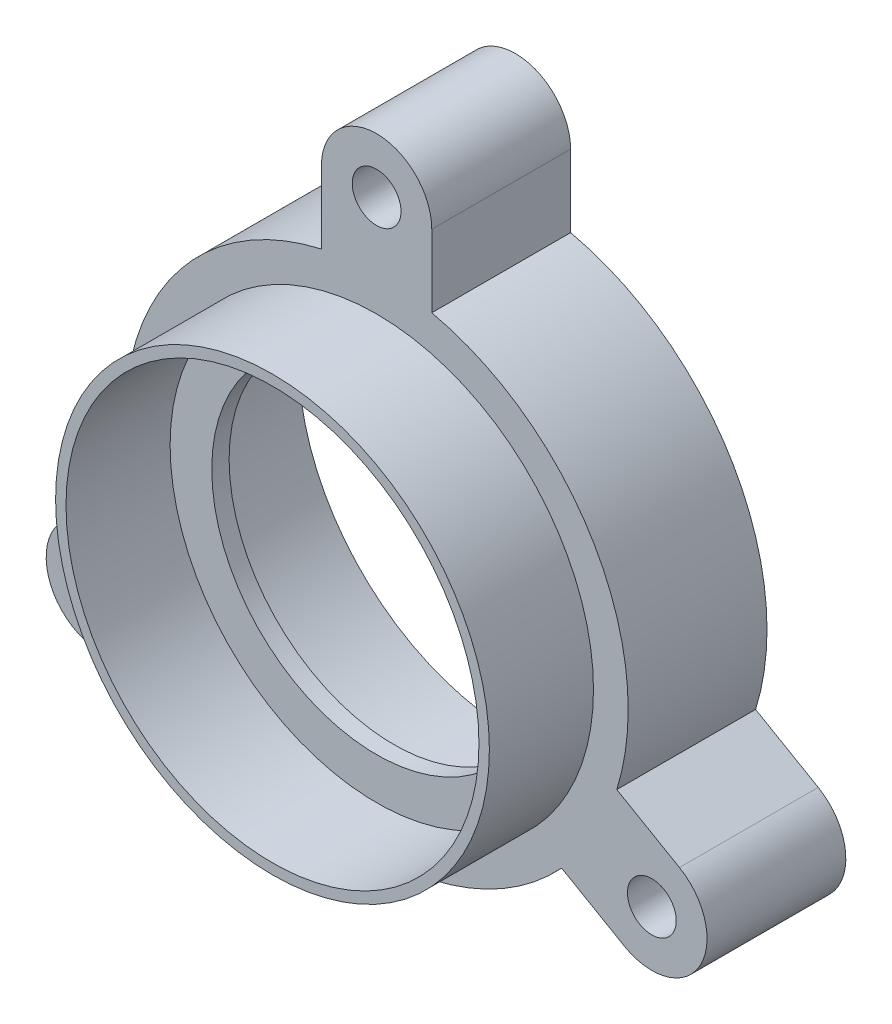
ISO-10303-21;
HEADER;
FILE_DESCRIPTION(('STEP AP214'),'2;1');
FILE_NAME('part.step','',(''),(''),'','','');
FILE_SCHEMA(('AUTOMOTIVE_DESIGN { 1 0 10303 214 1 1 1 1 }'));
ENDSEC;
DATA;
#1=APPLICATION_CONTEXT('core data for automotive mechanical design processes');
#2=APPLICATION_PROTOCOL_DEFINITION('international standard','automotive_design',2000,#1);
#3=PRODUCT_CONTEXT('',#1,'mechanical');
#4=PRODUCT('Part','Part','',(#3));
#5=PRODUCT_RELATED_PRODUCT_CATEGORY('part','',(#4));
#6=PRODUCT_DEFINITION_FORMATION('','',#4);
#7=PRODUCT_DEFINITION_CONTEXT('part definition',#1,'design');
#8=PRODUCT_DEFINITION('design','',#6,#7);
#9=PRODUCT_DEFINITION_SHAPE('','',#8);
#10=(LENGTH_UNIT() NAMED_UNIT(*) SI_UNIT(.MILLI.,.METRE.));
#11=(NAMED_UNIT(*) PLANE_ANGLE_UNIT() SI_UNIT($,.RADIAN.));
#12=(NAMED_UNIT(*) SI_UNIT($,.STERADIAN.) SOLID_ANGLE_UNIT());
#13=UNCERTAINTY_MEASURE_WITH_UNIT(LENGTH_MEASURE(1.E-05),#10,'distance_accuracy_value','');
#14=(GEOMETRIC_REPRESENTATION_CONTEXT(3) GLOBAL_UNCERTAINTY_ASSIGNED_CONTEXT((#13)) GLOBAL_UNIT_ASSIGNED_CONTEXT((#10,
#11,#12)) REPRESENTATION_CONTEXT('',''));
#15=CARTESIAN_POINT('',(0.,0.,0.));
#16=DIRECTION('',(0.,0.,1.));
#17=DIRECTION('',(1.,0.,0.));
#18=AXIS2_PLACEMENT_3D('',#15,#16,#17);
#19=CARTESIAN_POINT('',(0.,0.,8.));
#20=DIRECTION('',(0.,0.,-1.));
#21=DIRECTION('',(-1.,0.,0.));
#22=AXIS2_PLACEMENT_3D('',#19,#20,#21);
#23=CYLINDRICAL_SURFACE('',#22,14.5);
#24=CARTESIAN_POINT('',(0.,0.,8.));
#25=DIRECTION('',(0.,0.,1.));
#26=DIRECTION('',(1.,0.,0.));
#27=AXIS2_PLACEMENT_3D('',#24,#25,#26);
#28=CIRCLE('',#27,14.5);
#29=CARTESIAN_POINT('',(-10.6616611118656,-9.82746062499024,8.));
#30=VERTEX_POINT('',#29);
#31=CARTESIAN_POINT('',(10.6616611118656,-9.82746062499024,8.));
#32=VERTEX_POINT('',#31);
#33=EDGE_CURVE('E144',#30,#32,#28,.T.);
#34=ORIENTED_EDGE('',*,*,#33,.F.);
#35=DIRECTION('',(0.,0.,1.));
#36=VECTOR('',#35,1.);
#37=CARTESIAN_POINT('',(-10.6616611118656,-9.82746062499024,0.));
#38=LINE('',#37,#36);
#39=CARTESIAN_POINT('',(-10.6616611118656,-9.82746062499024,0.));
#40=VERTEX_POINT('',#39);
#41=EDGE_CURVE('E236',#40,#30,#38,.T.);
#42=ORIENTED_EDGE('',*,*,#41,.F.);
#43=CARTESIAN_POINT('',(0.,0.,0.));
#44=DIRECTION('',(0.,0.,1.));
#45=DIRECTION('',(1.,0.,0.));
#46=AXIS2_PLACEMENT_3D('',#43,#44,#45);
#47=CIRCLE('',#46,14.5);
#48=CARTESIAN_POINT('',(10.6616611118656,-9.82746062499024,0.));
#49=VERTEX_POINT('',#48);
#50=EDGE_CURVE('E150',#40,#49,#47,.T.);
#51=ORIENTED_EDGE('',*,*,#50,.T.);
#52=DIRECTION('',(0.,0.,1.));
#53=VECTOR('',#52,1.);
#54=CARTESIAN_POINT('',(10.6616611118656,-9.82746062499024,0.));
#55=LINE('',#54,#53);
#56=EDGE_CURVE('E209',#49,#32,#55,.T.);
#57=ORIENTED_EDGE('',*,*,#56,.T.);
#58=EDGE_LOOP('',(#34,#42,#51,#57));
#59=FACE_BOUND('',#58,.T.);
#60=ADVANCED_FACE('F29',(#59),#23,.T.);
#61=CARTESIAN_POINT('',(13.8416611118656,-4.31953905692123,8.));
#62=VERTEX_POINT('',#61);
#63=CARTESIAN_POINT('',(3.18,14.1469996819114,8.));
#64=VERTEX_POINT('',#63);
#65=EDGE_CURVE('E145',#62,#64,#28,.T.);
#66=ORIENTED_EDGE('',*,*,#65,.F.);
#67=DIRECTION('',(0.,0.,1.));
#68=VECTOR('',#67,1.);
#69=CARTESIAN_POINT('',(13.8416611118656,-4.31953905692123,0.));
#70=LINE('',#69,#68);
#71=CARTESIAN_POINT('',(13.8416611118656,-4.31953905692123,0.));
#72=VERTEX_POINT('',#71);
#73=EDGE_CURVE('E208',#72,#62,#70,.T.);
#74=ORIENTED_EDGE('',*,*,#73,.F.);
#75=CARTESIAN_POINT('',(3.18,14.1469996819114,0.));
#76=VERTEX_POINT('',#75);
#77=EDGE_CURVE('E151',#72,#76,#47,.T.);
#78=ORIENTED_EDGE('',*,*,#77,.T.);
#79=DIRECTION('',(0.,0.,1.));
#80=VECTOR('',#79,1.);
#81=CARTESIAN_POINT('',(3.18,14.1469996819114,0.));
#82=LINE('',#81,#80);
#83=EDGE_CURVE('E182',#76,#64,#82,.T.);
#84=ORIENTED_EDGE('',*,*,#83,.T.);
#85=EDGE_LOOP('',(#66,#74,#78,#84));
#86=FACE_BOUND('',#85,.T.);
#87=ADVANCED_FACE('F260',(#86),#23,.T.);
#88=CARTESIAN_POINT('',(0.,0.,8.));
#89=DIRECTION('',(0.,0.,1.));
#90=DIRECTION('',(1.,0.,0.));
#91=AXIS2_PLACEMENT_3D('',#88,#89,#90);
#92=PLANE('',#91);
#93=CARTESIAN_POINT('',(-3.18,14.1469996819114,8.));
#94=VERTEX_POINT('',#93);
#95=CARTESIAN_POINT('',(-13.8416611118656,-4.31953905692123,8.));
#96=VERTEX_POINT('',#95);
#97=EDGE_CURVE('E37',#94,#96,#28,.T.);
#98=ORIENTED_EDGE('',*,*,#97,.T.);
#99=DIRECTION('',(-0.866025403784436,-0.500000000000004,0.));
#100=VECTOR('',#99,1.);
#101=CARTESIAN_POINT('',(-13.8416611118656,-4.31953905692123,8.));
#102=LINE('',#101,#100);
#103=CARTESIAN_POINT('',(-17.4529870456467,-6.40453905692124,8.));
#104=VERTEX_POINT('',#103);
#105=EDGE_CURVE('E118',#96,#104,#102,.T.);
#106=ORIENTED_EDGE('',*,*,#105,.T.);
#107=CARTESIAN_POINT('',(-15.8629870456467,-9.15849984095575,8.));
#108=DIRECTION('',(0.,0.,1.));
#109=DIRECTION('',(-1.,0.,0.));
#110=AXIS2_PLACEMENT_3D('',#107,#108,#109);
#111=CIRCLE('',#110,3.18);
#112=CARTESIAN_POINT('',(-14.2729870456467,-11.9124606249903,8.));
#113=VERTEX_POINT('',#112);
#114=EDGE_CURVE('E127',#104,#113,#111,.T.);
#115=ORIENTED_EDGE('',*,*,#114,.T.);
#116=DIRECTION('',(0.866025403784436,0.500000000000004,0.));
#117=VECTOR('',#116,1.);
#118=CARTESIAN_POINT('',(-10.6616611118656,-9.82746062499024,8.));
#119=LINE('',#118,#117);
#120=EDGE_CURVE('E44',#113,#30,#119,.T.);
#121=ORIENTED_EDGE('',*,*,#120,.T.);
#122=ORIENTED_EDGE('',*,*,#33,.T.);
#123=DIRECTION('',(0.866025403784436,-0.500000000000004,0.));
#124=VECTOR('',#123,1.);
#125=CARTESIAN_POINT('',(10.6616611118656,-9.82746062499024,8.));
#126=LINE('',#125,#124);
#127=CARTESIAN_POINT('',(14.2729870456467,-11.9124606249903,8.));
#128=VERTEX_POINT('',#127);
#129=EDGE_CURVE('E228',#32,#128,#126,.T.);
#130=ORIENTED_EDGE('',*,*,#129,.T.);
#131=CARTESIAN_POINT('',(15.8629870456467,-9.15849984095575,8.));
#132=DIRECTION('',(0.,0.,1.));
#133=DIRECTION('',(1.,0.,0.));
#134=AXIS2_PLACEMENT_3D('',#131,#132,#133);
#135=CIRCLE('',#134,3.18);
#136=CARTESIAN_POINT('',(17.4529870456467,-6.40453905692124,8.));
#137=VERTEX_POINT('',#136);
#138=EDGE_CURVE('E226',#128,#137,#135,.T.);
#139=ORIENTED_EDGE('',*,*,#138,.T.);
#140=DIRECTION('',(-0.866025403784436,0.500000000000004,0.));
#141=VECTOR('',#140,1.);
#142=CARTESIAN_POINT('',(13.8416611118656,-4.31953905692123,8.));
#143=LINE('',#142,#141);
#144=EDGE_CURVE('E51',#137,#62,#143,.T.);
#145=ORIENTED_EDGE('',*,*,#144,.T.);
#146=ORIENTED_EDGE('',*,*,#65,.T.);
#147=DIRECTION('',(0.,1.,0.));
#148=VECTOR('',#147,1.);
#149=CARTESIAN_POINT('',(3.18,14.1469996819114,8.));
#150=LINE('',#149,#148);
#151=CARTESIAN_POINT('',(3.18,18.3169996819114,8.));
#152=VERTEX_POINT('',#151);
#153=EDGE_CURVE('E200',#64,#152,#150,.T.);
#154=ORIENTED_EDGE('',*,*,#153,.T.);
#155=CARTESIAN_POINT('',(0.,18.3169996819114,8.));
#156=DIRECTION('',(0.,0.,1.));
#157=DIRECTION('',(-1.,0.,0.));
#158=AXIS2_PLACEMENT_3D('',#155,#156,#157);
#159=CIRCLE('',#158,3.18);
#160=CARTESIAN_POINT('',(-3.18,18.3169996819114,8.));
#161=VERTEX_POINT('',#160);
#162=EDGE_CURVE('E198',#152,#161,#159,.T.);
#163=ORIENTED_EDGE('',*,*,#162,.T.);
#164=DIRECTION('',(0.,-1.,0.));
#165=VECTOR('',#164,1.);
#166=CARTESIAN_POINT('',(-3.18,14.1469996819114,8.));
#167=LINE('',#166,#165);
#168=EDGE_CURVE('E142',#161,#94,#167,.T.);
#169=ORIENTED_EDGE('',*,*,#168,.T.);
#170=EDGE_LOOP('',(#98,#106,#115,#121,#122,#130,#139,#145,#146,#154,#163,#169));
#171=FACE_BOUND('',#170,.T.);
#172=CARTESIAN_POINT('',(0.,0.,8.));
#173=DIRECTION('',(0.,0.,1.));
#174=DIRECTION('',(1.,0.,0.));
#175=AXIS2_PLACEMENT_3D('',#172,#173,#174);
#176=CIRCLE('',#175,12.5);
#177=CARTESIAN_POINT('',(12.5,0.,8.));
#178=VERTEX_POINT('',#177);
#179=EDGE_CURVE('E175',#178,#178,#176,.T.);
#180=ORIENTED_EDGE('',*,*,#179,.F.);
#181=EDGE_LOOP('',(#180));
#182=FACE_BOUND('',#181,.T.);
#183=CARTESIAN_POINT('',(0.,18.3169996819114,8.));
#184=DIRECTION('',(0.,0.,1.));
#185=DIRECTION('',(1.,0.,0.));
#186=AXIS2_PLACEMENT_3D('',#183,#184,#185);
#187=CIRCLE('',#186,1.405);
#188=CARTESIAN_POINT('',(1.405,18.3169996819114,8.));
#189=VERTEX_POINT('',#188);
#190=EDGE_CURVE('E205',#189,#189,#187,.T.);
#191=ORIENTED_EDGE('',*,*,#190,.F.);
#192=EDGE_LOOP('',(#191));
#193=FACE_BOUND('',#192,.T.);
#194=CARTESIAN_POINT('',(15.8629870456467,-9.15849984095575,8.));
#195=DIRECTION('',(0.,0.,1.));
#196=DIRECTION('',(-1.,0.,0.));
#197=AXIS2_PLACEMENT_3D('',#194,#195,#196);
#198=CIRCLE('',#197,1.405);
#199=CARTESIAN_POINT('',(14.4579870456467,-9.15849984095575,8.));
#200=VERTEX_POINT('',#199);
#201=EDGE_CURVE('E234',#200,#200,#198,.T.);
#202=ORIENTED_EDGE('',*,*,#201,.F.);
#203=EDGE_LOOP('',(#202));
#204=FACE_BOUND('',#203,.T.);
#205=CARTESIAN_POINT('',(-15.8629870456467,-9.15849984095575,8.));
#206=DIRECTION('',(0.,0.,1.));
#207=DIRECTION('',(1.,0.,0.));
#208=AXIS2_PLACEMENT_3D('',#205,#206,#207);
#209=CIRCLE('',#208,1.405);
#210=CARTESIAN_POINT('',(-14.4579870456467,-9.15849984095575,8.));
#211=VERTEX_POINT('',#210);
#212=EDGE_CURVE('E252',#211,#211,#209,.T.);
#213=ORIENTED_EDGE('',*,*,#212,.F.);
#214=EDGE_LOOP('',(#213));
#215=FACE_BOUND('',#214,.T.);
#216=ADVANCED_FACE('F138',(#171,#182,#193,#204,#215),#92,.T.);
#217=CARTESIAN_POINT('',(0.,0.,8.));
#218=DIRECTION('',(0.,0.,-1.));
#219=DIRECTION('',(-1.,0.,0.));
#220=AXIS2_PLACEMENT_3D('',#217,#218,#219);
#221=CYLINDRICAL_SURFACE('',#220,12.5);
#222=CARTESIAN_POINT('',(0.,0.,0.));
#223=DIRECTION('',(0.,0.,1.));
#224=DIRECTION('',(1.,0.,0.));
#225=AXIS2_PLACEMENT_3D('',#222,#223,#224);
#226=CIRCLE('',#225,12.5);
#227=CARTESIAN_POINT('',(12.5,0.,0.));
#228=VERTEX_POINT('',#227);
#229=EDGE_CURVE('E153',#228,#228,#226,.T.);
#230=ORIENTED_EDGE('',*,*,#229,.F.);
#231=EDGE_LOOP('',(#230));
#232=FACE_BOUND('',#231,.T.);
#233=CARTESIAN_POINT('',(0.,0.,7.));
#234=DIRECTION('',(0.,0.,1.));
#235=DIRECTION('',(1.,0.,0.));
#236=AXIS2_PLACEMENT_3D('',#233,#234,#235);
#237=CIRCLE('',#236,12.5);
#238=CARTESIAN_POINT('',(12.5,0.,7.));
#239=VERTEX_POINT('',#238);
#240=EDGE_CURVE('E160',#239,#239,#237,.T.);
#241=ORIENTED_EDGE('',*,*,#240,.T.);
#242=EDGE_LOOP('',(#241));
#243=FACE_BOUND('',#242,.T.);
#244=ADVANCED_FACE('F259',(#232,#243),#221,.F.);
#245=CARTESIAN_POINT('',(0.,0.,8.));
#246=DIRECTION('',(0.,0.,1.));
#247=DIRECTION('',(1.,0.,0.));
#248=AXIS2_PLACEMENT_3D('',#245,#246,#247);
#249=CIRCLE('',#248,11.9);
#250=CARTESIAN_POINT('',(11.9,0.,8.));
#251=VERTEX_POINT('',#250);
#252=EDGE_CURVE('E11',#251,#251,#249,.F.);
#253=ORIENTED_EDGE('',*,*,#252,.F.);
#254=EDGE_LOOP('',(#253));
#255=FACE_BOUND('',#254,.T.);
#256=CARTESIAN_POINT('',(0.,0.,8.));
#257=DIRECTION('',(0.,0.,1.));
#258=DIRECTION('',(1.,0.,0.));
#259=AXIS2_PLACEMENT_3D('',#256,#257,#258);
#260=CIRCLE('',#259,9.5);
#261=CARTESIAN_POINT('',(9.5,0.,8.));
#262=VERTEX_POINT('',#261);
#263=EDGE_CURVE('E169',#262,#262,#260,.T.);
#264=ORIENTED_EDGE('',*,*,#263,.F.);
#265=EDGE_LOOP('',(#264));
#266=FACE_BOUND('',#265,.T.);
#267=ADVANCED_FACE('F261',(#255,#266),#92,.T.);
#268=CARTESIAN_POINT('',(0.,0.,0.));
#269=DIRECTION('',(0.,0.,1.));
#270=DIRECTION('',(1.,0.,0.));
#271=AXIS2_PLACEMENT_3D('',#268,#269,#270);
#272=PLANE('',#271);
#273=CARTESIAN_POINT('',(-3.18,14.1469996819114,0.));
#274=VERTEX_POINT('',#273);
#275=CARTESIAN_POINT('',(-13.8416611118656,-4.31953905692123,0.));
#276=VERTEX_POINT('',#275);
#277=EDGE_CURVE('E135',#274,#276,#47,.T.);
#278=ORIENTED_EDGE('',*,*,#277,.F.);
#279=DIRECTION('',(0.,-1.,0.));
#280=VECTOR('',#279,1.);
#281=CARTESIAN_POINT('',(-3.18,14.1469996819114,0.));
#282=LINE('',#281,#280);
#283=CARTESIAN_POINT('',(-3.18,18.3169996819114,0.));
#284=VERTEX_POINT('',#283);
#285=EDGE_CURVE('E185',#284,#274,#282,.T.);
#286=ORIENTED_EDGE('',*,*,#285,.F.);
#287=CARTESIAN_POINT('',(0.,18.3169996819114,0.));
#288=DIRECTION('',(0.,0.,1.));
#289=DIRECTION('',(-1.,0.,0.));
#290=AXIS2_PLACEMENT_3D('',#287,#288,#289);
#291=CIRCLE('',#290,3.18);
#292=CARTESIAN_POINT('',(3.18,18.3169996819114,0.));
#293=VERTEX_POINT('',#292);
#294=EDGE_CURVE('E191',#293,#284,#291,.T.);
#295=ORIENTED_EDGE('',*,*,#294,.F.);
#296=DIRECTION('',(0.,1.,0.));
#297=VECTOR('',#296,1.);
#298=CARTESIAN_POINT('',(3.18,14.1469996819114,0.));
#299=LINE('',#298,#297);
#300=EDGE_CURVE('E194',#76,#293,#299,.T.);
#301=ORIENTED_EDGE('',*,*,#300,.F.);
#302=ORIENTED_EDGE('',*,*,#77,.F.);
#303=DIRECTION('',(-0.866025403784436,0.500000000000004,0.));
#304=VECTOR('',#303,1.);
#305=CARTESIAN_POINT('',(13.8416611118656,-4.31953905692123,0.));
#306=LINE('',#305,#304);
#307=CARTESIAN_POINT('',(17.4529870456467,-6.40453905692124,0.));
#308=VERTEX_POINT('',#307);
#309=EDGE_CURVE('E213',#308,#72,#306,.T.);
#310=ORIENTED_EDGE('',*,*,#309,.F.);
#311=CARTESIAN_POINT('',(15.8629870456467,-9.15849984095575,0.));
#312=DIRECTION('',(0.,0.,1.));
#313=DIRECTION('',(1.,0.,0.));
#314=AXIS2_PLACEMENT_3D('',#311,#312,#313);
#315=CIRCLE('',#314,3.18);
#316=CARTESIAN_POINT('',(14.2729870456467,-11.9124606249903,0.));
#317=VERTEX_POINT('',#316);
#318=EDGE_CURVE('E219',#317,#308,#315,.T.);
#319=ORIENTED_EDGE('',*,*,#318,.F.);
#320=DIRECTION('',(0.866025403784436,-0.500000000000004,0.));
#321=VECTOR('',#320,1.);
#322=CARTESIAN_POINT('',(10.6616611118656,-9.82746062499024,0.));
#323=LINE('',#322,#321);
#324=EDGE_CURVE('E222',#49,#317,#323,.T.);
#325=ORIENTED_EDGE('',*,*,#324,.F.);
#326=ORIENTED_EDGE('',*,*,#50,.F.);
#327=DIRECTION('',(0.866025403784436,0.500000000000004,0.));
#328=VECTOR('',#327,1.);
#329=CARTESIAN_POINT('',(-10.6616611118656,-9.82746062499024,0.));
#330=LINE('',#329,#328);
#331=CARTESIAN_POINT('',(-14.2729870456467,-11.9124606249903,0.));
#332=VERTEX_POINT('',#331);
#333=EDGE_CURVE('E136',#332,#40,#330,.T.);
#334=ORIENTED_EDGE('',*,*,#333,.F.);
#335=CARTESIAN_POINT('',(-15.8629870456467,-9.15849984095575,0.));
#336=DIRECTION('',(0.,0.,1.));
#337=DIRECTION('',(-1.,0.,0.));
#338=AXIS2_PLACEMENT_3D('',#335,#336,#337);
#339=CIRCLE('',#338,3.18);
#340=CARTESIAN_POINT('',(-17.4529870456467,-6.40453905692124,0.));
#341=VERTEX_POINT('',#340);
#342=EDGE_CURVE('E243',#341,#332,#339,.T.);
#343=ORIENTED_EDGE('',*,*,#342,.F.);
#344=DIRECTION('',(-0.866025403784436,-0.500000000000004,0.));
#345=VECTOR('',#344,1.);
#346=CARTESIAN_POINT('',(-13.8416611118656,-4.31953905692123,0.));
#347=LINE('',#346,#345);
#348=EDGE_CURVE('E246',#276,#341,#347,.T.);
#349=ORIENTED_EDGE('',*,*,#348,.F.);
#350=EDGE_LOOP('',(#278,#286,#295,#301,#302,#310,#319,#325,#326,#334,#343,#349));
#351=FACE_BOUND('',#350,.T.);
#352=ORIENTED_EDGE('',*,*,#229,.T.);
#353=EDGE_LOOP('',(#352));
#354=FACE_BOUND('',#353,.T.);
#355=CARTESIAN_POINT('',(0.,18.3169996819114,0.));
#356=DIRECTION('',(0.,0.,1.));
#357=DIRECTION('',(1.,0.,0.));
#358=AXIS2_PLACEMENT_3D('',#355,#356,#357);
#359=CIRCLE('',#358,1.405);
#360=CARTESIAN_POINT('',(1.405,18.3169996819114,0.));
#361=VERTEX_POINT('',#360);
#362=EDGE_CURVE('E202',#361,#361,#359,.T.);
#363=ORIENTED_EDGE('',*,*,#362,.T.);
#364=EDGE_LOOP('',(#363));
#365=FACE_BOUND('',#364,.T.);
#366=CARTESIAN_POINT('',(15.8629870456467,-9.15849984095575,0.));
#367=DIRECTION('',(0.,0.,1.));
#368=DIRECTION('',(-1.,0.,0.));
#369=AXIS2_PLACEMENT_3D('',#366,#367,#368);
#370=CIRCLE('',#369,1.405);
#371=CARTESIAN_POINT('',(14.4579870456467,-9.15849984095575,0.));
#372=VERTEX_POINT('',#371);
#373=EDGE_CURVE('E231',#372,#372,#370,.T.);
#374=ORIENTED_EDGE('',*,*,#373,.T.);
#375=EDGE_LOOP('',(#374));
#376=FACE_BOUND('',#375,.T.);
#377=CARTESIAN_POINT('',(-15.8629870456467,-9.15849984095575,0.));
#378=DIRECTION('',(0.,0.,1.));
#379=DIRECTION('',(1.,0.,0.));
#380=AXIS2_PLACEMENT_3D('',#377,#378,#379);
#381=CIRCLE('',#380,1.405);
#382=CARTESIAN_POINT('',(-14.4579870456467,-9.15849984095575,0.));
#383=VERTEX_POINT('',#382);
#384=EDGE_CURVE('E128',#383,#383,#381,.T.);
#385=ORIENTED_EDGE('',*,*,#384,.T.);
#386=EDGE_LOOP('',(#385));
#387=FACE_BOUND('',#386,.T.);
#388=ADVANCED_FACE('F270',(#351,#354,#365,#376,#387),#272,.F.);
#389=ORIENTED_EDGE('',*,*,#277,.T.);
#390=DIRECTION('',(0.,0.,1.));
#391=VECTOR('',#390,1.);
#392=CARTESIAN_POINT('',(-13.8416611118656,-4.31953905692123,0.));
#393=LINE('',#392,#391);
#394=EDGE_CURVE('E122',#276,#96,#393,.T.);
#395=ORIENTED_EDGE('',*,*,#394,.T.);
#396=ORIENTED_EDGE('',*,*,#97,.F.);
#397=DIRECTION('',(0.,0.,1.));
#398=VECTOR('',#397,1.);
#399=CARTESIAN_POINT('',(-3.18,14.1469996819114,0.));
#400=LINE('',#399,#398);
#401=EDGE_CURVE('E181',#274,#94,#400,.T.);
#402=ORIENTED_EDGE('',*,*,#401,.F.);
#403=EDGE_LOOP('',(#389,#395,#396,#402));
#404=FACE_BOUND('',#403,.T.);
#405=ADVANCED_FACE('F31',(#404),#23,.T.);
#406=CARTESIAN_POINT('',(0.,0.,7.));
#407=DIRECTION('',(0.,0.,1.));
#408=DIRECTION('',(1.,0.,0.));
#409=AXIS2_PLACEMENT_3D('',#406,#407,#408);
#410=PLANE('',#409);
#411=CARTESIAN_POINT('',(0.,0.,7.));
#412=DIRECTION('',(0.,0.,1.));
#413=DIRECTION('',(1.,0.,0.));
#414=AXIS2_PLACEMENT_3D('',#411,#412,#413);
#415=CIRCLE('',#414,9.5);
#416=CARTESIAN_POINT('',(9.5,0.,7.));
#417=VERTEX_POINT('',#416);
#418=EDGE_CURVE('E164',#417,#417,#415,.T.);
#419=ORIENTED_EDGE('',*,*,#418,.T.);
#420=EDGE_LOOP('',(#419));
#421=FACE_BOUND('',#420,.T.);
#422=ORIENTED_EDGE('',*,*,#240,.F.);
#423=EDGE_LOOP('',(#422));
#424=FACE_BOUND('',#423,.T.);
#425=ADVANCED_FACE('F278',(#421,#424),#410,.F.);
#426=CARTESIAN_POINT('',(0.,0.,7.));
#427=DIRECTION('',(0.,0.,1.));
#428=DIRECTION('',(1.,0.,0.));
#429=AXIS2_PLACEMENT_3D('',#426,#427,#428);
#430=CYLINDRICAL_SURFACE('',#429,9.5);
#431=ORIENTED_EDGE('',*,*,#418,.F.);
#432=EDGE_LOOP('',(#431));
#433=FACE_BOUND('',#432,.T.);
#434=ORIENTED_EDGE('',*,*,#263,.T.);
#435=EDGE_LOOP('',(#434));
#436=FACE_BOUND('',#435,.T.);
#437=ADVANCED_FACE('F283',(#433,#436),#430,.F.);
#438=CARTESIAN_POINT('',(0.,0.,14.));
#439=DIRECTION('',(0.,0.,1.));
#440=DIRECTION('',(1.,0.,0.));
#441=AXIS2_PLACEMENT_3D('',#438,#439,#440);
#442=PLANE('',#441);
#443=CARTESIAN_POINT('',(0.,0.,14.));
#444=DIRECTION('',(0.,0.,1.));
#445=DIRECTION('',(1.,0.,0.));
#446=AXIS2_PLACEMENT_3D('',#443,#444,#445);
#447=CIRCLE('',#446,12.5);
#448=CARTESIAN_POINT('',(12.5,0.,14.));
#449=VERTEX_POINT('',#448);
#450=EDGE_CURVE('E172',#449,#449,#447,.T.);
#451=ORIENTED_EDGE('',*,*,#450,.T.);
#452=EDGE_LOOP('',(#451));
#453=FACE_BOUND('',#452,.T.);
#454=CARTESIAN_POINT('',(0.,0.,14.));
#455=DIRECTION('',(0.,0.,1.));
#456=DIRECTION('',(1.,0.,0.));
#457=AXIS2_PLACEMENT_3D('',#454,#455,#456);
#458=CIRCLE('',#457,11.9);
#459=CARTESIAN_POINT('',(11.9,0.,14.));
#460=VERTEX_POINT('',#459);
#461=EDGE_CURVE('E178',#460,#460,#458,.T.);
#462=ORIENTED_EDGE('',*,*,#461,.F.);
#463=EDGE_LOOP('',(#462));
#464=FACE_BOUND('',#463,.T.);
#465=ADVANCED_FACE('F292',(#453,#464),#442,.T.);
#466=CARTESIAN_POINT('',(0.,0.,14.));
#467=DIRECTION('',(0.,0.,-1.));
#468=DIRECTION('',(-1.,0.,0.));
#469=AXIS2_PLACEMENT_3D('',#466,#467,#468);
#470=CYLINDRICAL_SURFACE('',#469,12.5);
#471=ORIENTED_EDGE('',*,*,#450,.F.);
#472=EDGE_LOOP('',(#471));
#473=FACE_BOUND('',#472,.T.);
#474=ORIENTED_EDGE('',*,*,#179,.T.);
#475=EDGE_LOOP('',(#474));
#476=FACE_BOUND('',#475,.T.);
#477=ADVANCED_FACE('F294',(#473,#476),#470,.T.);
#478=CARTESIAN_POINT('',(0.,0.,14.));
#479=DIRECTION('',(0.,0.,-1.));
#480=DIRECTION('',(-1.,0.,0.));
#481=AXIS2_PLACEMENT_3D('',#478,#479,#480);
#482=CYLINDRICAL_SURFACE('',#481,11.9);
#483=ORIENTED_EDGE('',*,*,#461,.T.);
#484=EDGE_LOOP('',(#483));
#485=FACE_BOUND('',#484,.T.);
#486=ORIENTED_EDGE('',*,*,#252,.T.);
#487=EDGE_LOOP('',(#486));
#488=FACE_BOUND('',#487,.T.);
#489=ADVANCED_FACE('F297',(#485,#488),#482,.F.);
#490=CARTESIAN_POINT('',(-3.18,14.1469996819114,0.));
#491=DIRECTION('',(-1.,0.,0.));
#492=DIRECTION('',(0.,0.,1.));
#493=AXIS2_PLACEMENT_3D('',#490,#491,#492);
#494=PLANE('',#493);
#495=ORIENTED_EDGE('',*,*,#168,.F.);
#496=DIRECTION('',(0.,0.,1.));
#497=VECTOR('',#496,1.);
#498=CARTESIAN_POINT('',(-3.18,18.3169996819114,0.));
#499=LINE('',#498,#497);
#500=EDGE_CURVE('E187',#284,#161,#499,.T.);
#501=ORIENTED_EDGE('',*,*,#500,.F.);
#502=ORIENTED_EDGE('',*,*,#285,.T.);
#503=ORIENTED_EDGE('',*,*,#401,.T.);
#504=EDGE_LOOP('',(#495,#501,#502,#503));
#505=FACE_BOUND('',#504,.T.);
#506=ADVANCED_FACE('F304',(#505),#494,.T.);
#507=CARTESIAN_POINT('',(0.,18.3169996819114,0.));
#508=DIRECTION('',(0.,0.,1.));
#509=DIRECTION('',(1.,0.,0.));
#510=AXIS2_PLACEMENT_3D('',#507,#508,#509);
#511=CYLINDRICAL_SURFACE('',#510,3.18);
#512=ORIENTED_EDGE('',*,*,#162,.F.);
#513=DIRECTION('',(0.,0.,1.));
#514=VECTOR('',#513,1.);
#515=CARTESIAN_POINT('',(3.18,18.3169996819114,0.));
#516=LINE('',#515,#514);
#517=EDGE_CURVE('E184',#293,#152,#516,.T.);
#518=ORIENTED_EDGE('',*,*,#517,.F.);
#519=ORIENTED_EDGE('',*,*,#294,.T.);
#520=ORIENTED_EDGE('',*,*,#500,.T.);
#521=EDGE_LOOP('',(#512,#518,#519,#520));
#522=FACE_BOUND('',#521,.T.);
#523=ADVANCED_FACE('F310',(#522),#511,.T.);
#524=CARTESIAN_POINT('',(3.18,14.1469996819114,0.));
#525=DIRECTION('',(1.,0.,0.));
#526=DIRECTION('',(0.,0.,-1.));
#527=AXIS2_PLACEMENT_3D('',#524,#525,#526);
#528=PLANE('',#527);
#529=ORIENTED_EDGE('',*,*,#153,.F.);
#530=ORIENTED_EDGE('',*,*,#83,.F.);
#531=ORIENTED_EDGE('',*,*,#300,.T.);
#532=ORIENTED_EDGE('',*,*,#517,.T.);
#533=EDGE_LOOP('',(#529,#530,#531,#532));
#534=FACE_BOUND('',#533,.T.);
#535=ADVANCED_FACE('F306',(#534),#528,.T.);
#536=CARTESIAN_POINT('',(0.,18.3169996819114,0.));
#537=DIRECTION('',(0.,0.,1.));
#538=DIRECTION('',(1.,0.,0.));
#539=AXIS2_PLACEMENT_3D('',#536,#537,#538);
#540=CYLINDRICAL_SURFACE('',#539,1.405);
#541=ORIENTED_EDGE('',*,*,#362,.F.);
#542=EDGE_LOOP('',(#541));
#543=FACE_BOUND('',#542,.T.);
#544=ORIENTED_EDGE('',*,*,#190,.T.);
#545=EDGE_LOOP('',(#544));
#546=FACE_BOUND('',#545,.T.);
#547=ADVANCED_FACE('F309',(#543,#546),#540,.F.);
#548=CARTESIAN_POINT('',(13.8416611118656,-4.31953905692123,0.));
#549=DIRECTION('',(0.500000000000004,0.866025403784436,0.));
#550=DIRECTION('',(-0.866025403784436,0.500000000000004,0.));
#551=AXIS2_PLACEMENT_3D('',#548,#549,#550);
#552=PLANE('',#551);
#553=ORIENTED_EDGE('',*,*,#144,.F.);
#554=DIRECTION('',(0.,0.,1.));
#555=VECTOR('',#554,1.);
#556=CARTESIAN_POINT('',(17.4529870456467,-6.40453905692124,0.));
#557=LINE('',#556,#555);
#558=EDGE_CURVE('E215',#308,#137,#557,.T.);
#559=ORIENTED_EDGE('',*,*,#558,.F.);
#560=ORIENTED_EDGE('',*,*,#309,.T.);
#561=ORIENTED_EDGE('',*,*,#73,.T.);
#562=EDGE_LOOP('',(#553,#559,#560,#561));
#563=FACE_BOUND('',#562,.T.);
#564=ADVANCED_FACE('F320',(#563),#552,.T.);
#565=CARTESIAN_POINT('',(15.8629870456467,-9.15849984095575,0.));
#566=DIRECTION('',(0.,0.,1.));
#567=DIRECTION('',(1.,0.,0.));
#568=AXIS2_PLACEMENT_3D('',#565,#566,#567);
#569=CYLINDRICAL_SURFACE('',#568,3.18);
#570=ORIENTED_EDGE('',*,*,#138,.F.);
#571=DIRECTION('',(0.,0.,1.));
#572=VECTOR('',#571,1.);
#573=CARTESIAN_POINT('',(14.2729870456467,-11.9124606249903,0.));
#574=LINE('',#573,#572);
#575=EDGE_CURVE('E212',#317,#128,#574,.T.);
#576=ORIENTED_EDGE('',*,*,#575,.F.);
#577=ORIENTED_EDGE('',*,*,#318,.T.);
#578=ORIENTED_EDGE('',*,*,#558,.T.);
#579=EDGE_LOOP('',(#570,#576,#577,#578));
#580=FACE_BOUND('',#579,.T.);
#581=ADVANCED_FACE('F326',(#580),#569,.T.);
#582=CARTESIAN_POINT('',(10.6616611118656,-9.82746062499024,0.));
#583=DIRECTION('',(-0.500000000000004,-0.866025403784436,0.));
#584=DIRECTION('',(0.866025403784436,-0.500000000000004,0.));
#585=AXIS2_PLACEMENT_3D('',#582,#583,#584);
#586=PLANE('',#585);
#587=ORIENTED_EDGE('',*,*,#129,.F.);
#588=ORIENTED_EDGE('',*,*,#56,.F.);
#589=ORIENTED_EDGE('',*,*,#324,.T.);
#590=ORIENTED_EDGE('',*,*,#575,.T.);
#591=EDGE_LOOP('',(#587,#588,#589,#590));
#592=FACE_BOUND('',#591,.T.);
#593=ADVANCED_FACE('F322',(#592),#586,.T.);
#594=CARTESIAN_POINT('',(15.8629870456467,-9.15849984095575,0.));
#595=DIRECTION('',(0.,0.,1.));
#596=DIRECTION('',(1.,0.,0.));
#597=AXIS2_PLACEMENT_3D('',#594,#595,#596);
#598=CYLINDRICAL_SURFACE('',#597,1.405);
#599=ORIENTED_EDGE('',*,*,#373,.F.);
#600=EDGE_LOOP('',(#599));
#601=FACE_BOUND('',#600,.T.);
#602=ORIENTED_EDGE('',*,*,#201,.T.);
#603=EDGE_LOOP('',(#602));
#604=FACE_BOUND('',#603,.T.);
#605=ADVANCED_FACE('F325',(#601,#604),#598,.F.);
#606=CARTESIAN_POINT('',(-10.6616611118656,-9.82746062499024,0.));
#607=DIRECTION('',(0.500000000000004,-0.866025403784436,0.));
#608=DIRECTION('',(0.866025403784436,0.500000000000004,0.));
#609=AXIS2_PLACEMENT_3D('',#606,#607,#608);
#610=PLANE('',#609);
#611=ORIENTED_EDGE('',*,*,#120,.F.);
#612=DIRECTION('',(0.,0.,1.));
#613=VECTOR('',#612,1.);
#614=CARTESIAN_POINT('',(-14.2729870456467,-11.9124606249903,0.));
#615=LINE('',#614,#613);
#616=EDGE_CURVE('E239',#332,#113,#615,.T.);
#617=ORIENTED_EDGE('',*,*,#616,.F.);
#618=ORIENTED_EDGE('',*,*,#333,.T.);
#619=ORIENTED_EDGE('',*,*,#41,.T.);
#620=EDGE_LOOP('',(#611,#617,#618,#619));
#621=FACE_BOUND('',#620,.T.);
#622=ADVANCED_FACE('F336',(#621),#610,.T.);
#623=CARTESIAN_POINT('',(-15.8629870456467,-9.15849984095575,0.));
#624=DIRECTION('',(0.,0.,1.));
#625=DIRECTION('',(1.,0.,0.));
#626=AXIS2_PLACEMENT_3D('',#623,#624,#625);
#627=CYLINDRICAL_SURFACE('',#626,3.18);
#628=ORIENTED_EDGE('',*,*,#114,.F.);
#629=DIRECTION('',(0.,0.,1.));
#630=VECTOR('',#629,1.);
#631=CARTESIAN_POINT('',(-17.4529870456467,-6.40453905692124,0.));
#632=LINE('',#631,#630);
#633=EDGE_CURVE('E124',#341,#104,#632,.T.);
#634=ORIENTED_EDGE('',*,*,#633,.F.);
#635=ORIENTED_EDGE('',*,*,#342,.T.);
#636=ORIENTED_EDGE('',*,*,#616,.T.);
#637=EDGE_LOOP('',(#628,#634,#635,#636));
#638=FACE_BOUND('',#637,.T.);
#639=ADVANCED_FACE('F340',(#638),#627,.T.);
#640=CARTESIAN_POINT('',(-13.8416611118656,-4.31953905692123,0.));
#641=DIRECTION('',(-0.500000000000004,0.866025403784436,0.));
#642=DIRECTION('',(-0.866025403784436,-0.500000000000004,0.));
#643=AXIS2_PLACEMENT_3D('',#640,#641,#642);
#644=PLANE('',#643);
#645=ORIENTED_EDGE('',*,*,#105,.F.);
#646=ORIENTED_EDGE('',*,*,#394,.F.);
#647=ORIENTED_EDGE('',*,*,#348,.T.);
#648=ORIENTED_EDGE('',*,*,#633,.T.);
#649=EDGE_LOOP('',(#645,#646,#647,#648));
#650=FACE_BOUND('',#649,.T.);
#651=ADVANCED_FACE('F120',(#650),#644,.T.);
#652=CARTESIAN_POINT('',(-15.8629870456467,-9.15849984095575,0.));
#653=DIRECTION('',(0.,0.,1.));
#654=DIRECTION('',(1.,0.,0.));
#655=AXIS2_PLACEMENT_3D('',#652,#653,#654);
#656=CYLINDRICAL_SURFACE('',#655,1.405);
#657=ORIENTED_EDGE('',*,*,#384,.F.);
#658=EDGE_LOOP('',(#657));
#659=FACE_BOUND('',#658,.T.);
#660=ORIENTED_EDGE('',*,*,#212,.T.);
#661=EDGE_LOOP('',(#660));
#662=FACE_BOUND('',#661,.T.);
#663=ADVANCED_FACE('F256',(#659,#662),#656,.F.);
#664=CLOSED_SHELL('',(#60,#87,#216,#244,#267,#388,#405,#425,#437,#465,#477,#489,#506,#523,#535,
#547,#564,#581,#593,#605,#622,#639,#651,#663));
#665=MANIFOLD_SOLID_BREP('B2',#664);
#666=ADVANCED_BREP_SHAPE_REPRESENTATION('',(#18,#665),#14);
#667=SHAPE_DEFINITION_REPRESENTATION(#9,#666);
ENDSEC;
END-ISO-10303-21;
